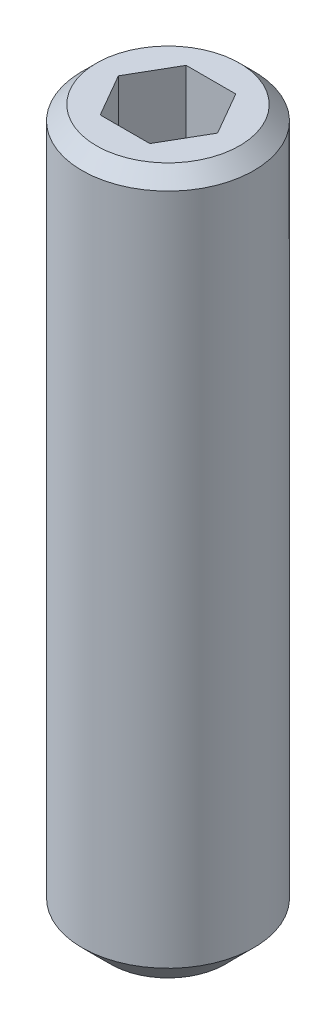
from build123d import *

# Parameters (mm, degrees)
ESQUISSE1_R             = 3
LONGUEUR_FILT_DEPTH     = 25
CHANFREIN1_SIZE         = 0.5
ENL_V_MAT_EXTRU_4_DEPTH = 3.5
ESQUISSE7_OUTSIDE_W     = 65.996
ESQUISSE7_OUTSIDE_H     = 65.996
ESQUISSE7_OUTSIDE_R     = 2
ENL_V_MAT_EXTRU_6_DEPTH = 26.357444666
ENL_V_MAT_EXTRU_6_DRAFT = -45


with BuildPart() as part:
    # Esquisse1 → Longueur filt (new body)
    with BuildSketch(Plane(origin=(0, 0, 0), x_dir=(1, 0, 0), z_dir=(0, 1, 0))):
        with Locations(Location((0, 0, 0), (0, 0, 270))):
            Circle(ESQUISSE1_R)
    extrude(amount=LONGUEUR_FILT_DEPTH)

    # Chanfrein1
    chanfrein1_edges = [part.edges().sort_by_distance(p)[0] for p in [
        (0, 25, -3),
    ]]
    chamfer(chanfrein1_edges, length=CHANFREIN1_SIZE)

    # Esquisse6 → Enl_v. mat.-Extru.4 (cut)
    with BuildSketch(Plane(origin=(0, 25, 0), x_dir=(-1, 0, 0), z_dir=(0, -1, 0))):
        Polygon((1.732050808, 0), (0.866025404, 1.5), (-0.866025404, 1.5), (-1.732050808, 0), (-0.866025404, -1.5), (0.866025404, -1.5), align=None)
    extrude(amount=ENL_V_MAT_EXTRU_4_DEPTH, mode=Mode.SUBTRACT)


with BuildPart() as enl_v_mat_extru_6_tool:
    # Esquisse7 outside → Enl_v. mat.-Extru.6 (with draft: the straight prism first)
    with BuildSketch(Plane.XZ):
        Rectangle(ESQUISSE7_OUTSIDE_W, ESQUISSE7_OUTSIDE_H)
        Circle(ESQUISSE7_OUTSIDE_R, mode=Mode.SUBTRACT)
    extrude(amount=-ENL_V_MAT_EXTRU_6_DEPTH)
    # Enl_v. mat.-Extru.6: the draft: its side faces are tilted about the plane it starts from
    enl_v_mat_extru_6_sides = [enl_v_mat_extru_6_tool.faces().sort_by_distance(p)[0] for p in [
        (0, 13.178722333, -32.998),
        (32.998, 13.178722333, 0),
        (0, 13.178722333, 32.998),
        (-32.998, 13.178722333, 0),
        (-2, 13.178722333, 0),
    ]]
    draft(enl_v_mat_extru_6_sides, Plane.XZ, ENL_V_MAT_EXTRU_6_DRAFT)


with BuildPart() as part_1:
    add(part.part)

    # Enl_v. mat.-Extru.6: cut by enl_v_mat_extru_6_tool
    add(enl_v_mat_extru_6_tool.part, mode=Mode.SUBTRACT)


solid = part_1.part
